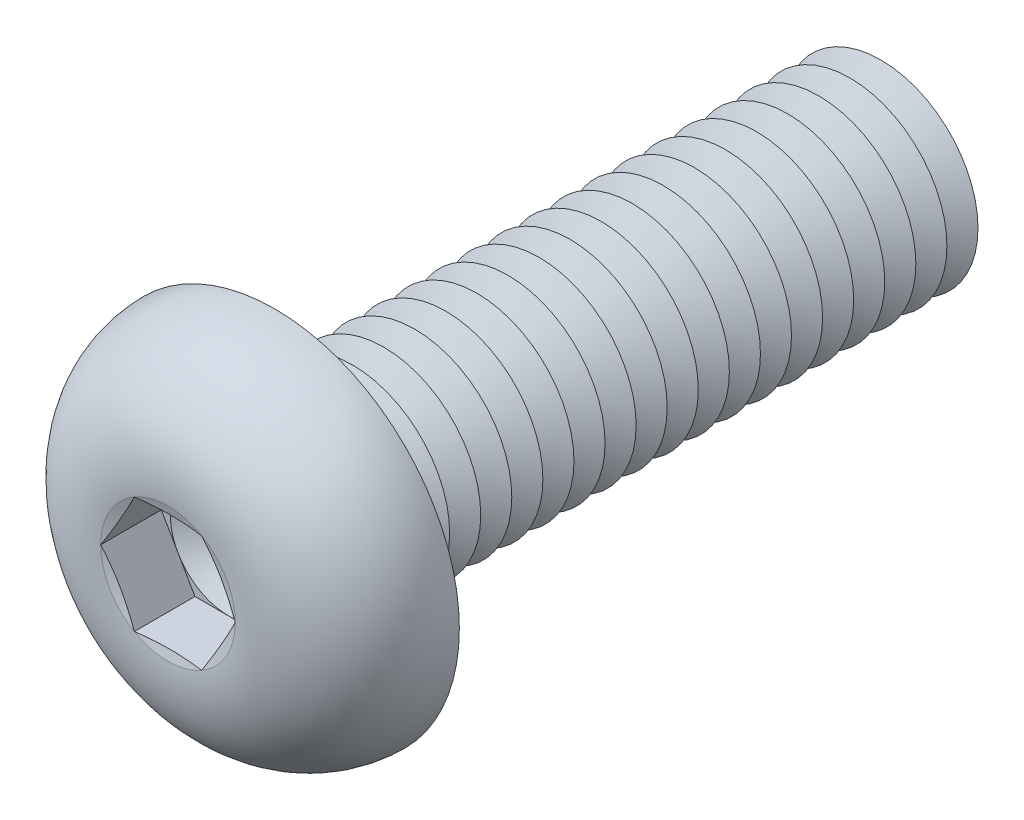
from build123d import *

# Parameters (mm, degrees)
FILLET1_R          = 0.4
LPATTERN1_COUNT    = 20
LPATTERN1_PITCH    = 0.8
CUT_EXTRUDE1_DEPTH = 1.56


with BuildPart() as part:
    # Sketch1 → Revolve1 (revolve)
    with BuildSketch(Plane(origin=(0, 0, 0), x_dir=(0, 0, -1), z_dir=(1, 0, 0)), mode=Mode.PRIVATE) as revolve1_sk:
        with BuildLine():
            Line((0, 2.5), (0, 4.75))
            ThreePointArc((0, 4.75), (-2.041477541, 3.848329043), (-2.75, 1.73205))
            Line((-2.75, 1.73205), (-2.517949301, 0.866025))
            Line((-2.517949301, 0.866025), (-2.75, 0.866025))
            Line((-2.75, 0.866025), (-2.75, 0))
            Line((-2.75, 0), (16, 0))
            Line((16, 0), (16, 2.5))
            Line((16, 2.5), (0, 2.5))
        make_face()
    revolve(revolve1_sk.sketch.rotate(Axis((0, 0, -16), (0, 0, 1)), 90), axis=Axis((0, 0, -16), (0, 0, 1)))

    # Fillet1
    fillet1_edges = [part.edges().sort_by_distance(p)[0] for p in [
        (2.5, 0, 0),
    ]]
    fillet(fillet1_edges, radius=FILLET1_R)

    # Sketch2 → Cut-Revolve1 (revolve, cut)
    with BuildSketch(Plane(origin=(0, 0, 0), x_dir=(0, 0, -1), z_dir=(1, 0, 0)), mode=Mode.PRIVATE) as cut_revolve1_sk:
        Polygon((15.6, 2.5), (16.4, 2.5), (16, 1.807179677), align=None)
    cut_revolve1 = revolve(cut_revolve1_sk.sketch.rotate(Axis((0, 0, -16), (0, 0, -1)), 270), axis=Axis((0, 0, -16), (0, 0, -1)), mode=Mode.SUBTRACT)

    # LPattern1: Cut-Revolve1 ×20
    with Locations(*[(0, 0, i * LPATTERN1_PITCH) for i in range(1, LPATTERN1_COUNT)]):
        add(cut_revolve1, mode=Mode.SUBTRACT)

    # Sketch3 → Cut-Extrude1 (cut)
    with BuildSketch(Plane.XY.offset(2.75)):
        Polygon((0.866025, 1.499999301), (-0.866025, 1.499999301), (-1.73205, 0), (-0.866025, -1.499999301), (0.866025, -1.499999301), (1.73205, 0), align=None)
    extrude(amount=-CUT_EXTRUDE1_DEPTH, mode=Mode.SUBTRACT)

    # Cut-Extrude2 cone 1 section (on through the dimple's axis) → Cut-Extrude2 (revolve, cut)
    with BuildSketch(Plane(origin=(0, 0, 1.19), x_dir=(0, -1, 0), z_dir=(1, 0, 0))):
        Polygon((0, 0), (1.499999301, 0), (0, 0.866025), align=None)
    revolve(axis=Axis((0, 0, 1.19), (0, 0, -1)), mode=Mode.SUBTRACT)


solid = part.part
